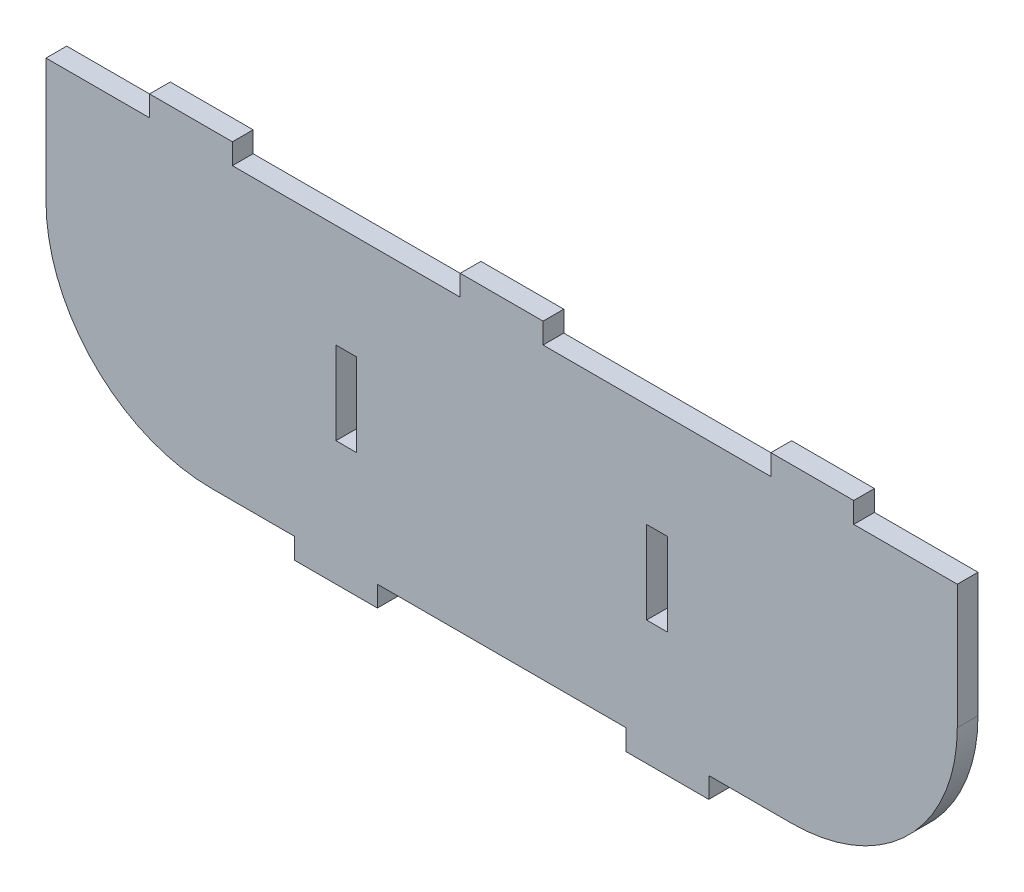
ISO-10303-21;
HEADER;
FILE_DESCRIPTION(('STEP AP214'),'2;1');
FILE_NAME('part.step','',(''),(''),'','','');
FILE_SCHEMA(('AUTOMOTIVE_DESIGN { 1 0 10303 214 1 1 1 1 }'));
ENDSEC;
DATA;
#1=APPLICATION_CONTEXT('core data for automotive mechanical design processes');
#2=APPLICATION_PROTOCOL_DEFINITION('international standard','automotive_design',2000,#1);
#3=PRODUCT_CONTEXT('',#1,'mechanical');
#4=PRODUCT('Part','Part','',(#3));
#5=PRODUCT_RELATED_PRODUCT_CATEGORY('part','',(#4));
#6=PRODUCT_DEFINITION_FORMATION('','',#4);
#7=PRODUCT_DEFINITION_CONTEXT('part definition',#1,'design');
#8=PRODUCT_DEFINITION('design','',#6,#7);
#9=PRODUCT_DEFINITION_SHAPE('','',#8);
#10=(LENGTH_UNIT() NAMED_UNIT(*) SI_UNIT(.MILLI.,.METRE.));
#11=(NAMED_UNIT(*) PLANE_ANGLE_UNIT() SI_UNIT($,.RADIAN.));
#12=(NAMED_UNIT(*) SI_UNIT($,.STERADIAN.) SOLID_ANGLE_UNIT());
#13=UNCERTAINTY_MEASURE_WITH_UNIT(LENGTH_MEASURE(1.E-05),#10,'distance_accuracy_value','');
#14=(GEOMETRIC_REPRESENTATION_CONTEXT(3) GLOBAL_UNCERTAINTY_ASSIGNED_CONTEXT((#13)) GLOBAL_UNIT_ASSIGNED_CONTEXT((#10,
#11,#12)) REPRESENTATION_CONTEXT('',''));
#15=CARTESIAN_POINT('',(0.,0.,0.));
#16=DIRECTION('',(0.,0.,1.));
#17=DIRECTION('',(1.,0.,0.));
#18=AXIS2_PLACEMENT_3D('',#15,#16,#17);
#19=CARTESIAN_POINT('',(-44.45,3.175,1.5875));
#20=DIRECTION('',(0.,0.,-1.));
#21=DIRECTION('',(-1.,0.,0.));
#22=AXIS2_PLACEMENT_3D('',#19,#20,#21);
#23=PLANE('',#22);
#24=DIRECTION('',(0.,1.,0.));
#25=VECTOR('',#24,1.);
#26=CARTESIAN_POINT('',(69.85,3.175,1.5875));
#27=LINE('',#26,#25);
#28=CARTESIAN_POINT('',(69.85,3.17500000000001,1.5875));
#29=VERTEX_POINT('',#28);
#30=CARTESIAN_POINT('',(69.85,22.225,1.5875));
#31=VERTEX_POINT('',#30);
#32=EDGE_CURVE('E443',#29,#31,#27,.T.);
#33=ORIENTED_EDGE('',*,*,#32,.T.);
#34=DIRECTION('',(-1.,0.,0.));
#35=VECTOR('',#34,1.);
#36=CARTESIAN_POINT('',(-69.85,22.225,1.5875));
#37=LINE('',#36,#35);
#38=CARTESIAN_POINT('',(53.975,22.225,1.5875));
#39=VERTEX_POINT('',#38);
#40=EDGE_CURVE('E487',#31,#39,#37,.T.);
#41=ORIENTED_EDGE('',*,*,#40,.T.);
#42=DIRECTION('',(0.,1.,0.));
#43=VECTOR('',#42,1.);
#44=CARTESIAN_POINT('',(53.975,22.225,1.5875));
#45=LINE('',#44,#43);
#46=CARTESIAN_POINT('',(53.975,25.4,1.5875));
#47=VERTEX_POINT('',#46);
#48=EDGE_CURVE('E309',#39,#47,#45,.T.);
#49=ORIENTED_EDGE('',*,*,#48,.T.);
#50=DIRECTION('',(-1.,0.,0.));
#51=VECTOR('',#50,1.);
#52=CARTESIAN_POINT('',(41.275,25.4,1.5875));
#53=LINE('',#52,#51);
#54=CARTESIAN_POINT('',(41.275,25.4,1.5875));
#55=VERTEX_POINT('',#54);
#56=EDGE_CURVE('E305',#47,#55,#53,.T.);
#57=ORIENTED_EDGE('',*,*,#56,.T.);
#58=DIRECTION('',(0.,-1.,0.));
#59=VECTOR('',#58,1.);
#60=CARTESIAN_POINT('',(41.275,22.225,1.5875));
#61=LINE('',#60,#59);
#62=CARTESIAN_POINT('',(41.275,22.225,1.5875));
#63=VERTEX_POINT('',#62);
#64=EDGE_CURVE('E298',#55,#63,#61,.T.);
#65=ORIENTED_EDGE('',*,*,#64,.T.);
#66=CARTESIAN_POINT('',(6.35,22.225,1.5875));
#67=VERTEX_POINT('',#66);
#68=EDGE_CURVE('E499',#63,#67,#37,.T.);
#69=ORIENTED_EDGE('',*,*,#68,.T.);
#70=DIRECTION('',(0.,1.,0.));
#71=VECTOR('',#70,1.);
#72=CARTESIAN_POINT('',(6.35,22.225,1.5875));
#73=LINE('',#72,#71);
#74=CARTESIAN_POINT('',(6.35,25.4,1.5875));
#75=VERTEX_POINT('',#74);
#76=EDGE_CURVE('E336',#67,#75,#73,.T.);
#77=ORIENTED_EDGE('',*,*,#76,.T.);
#78=DIRECTION('',(-1.,0.,0.));
#79=VECTOR('',#78,1.);
#80=CARTESIAN_POINT('',(-6.35,25.4,1.5875));
#81=LINE('',#80,#79);
#82=CARTESIAN_POINT('',(-6.35,25.4,1.5875));
#83=VERTEX_POINT('',#82);
#84=EDGE_CURVE('E332',#75,#83,#81,.T.);
#85=ORIENTED_EDGE('',*,*,#84,.T.);
#86=DIRECTION('',(0.,-1.,0.));
#87=VECTOR('',#86,1.);
#88=CARTESIAN_POINT('',(-6.35,22.225,1.5875));
#89=LINE('',#88,#87);
#90=CARTESIAN_POINT('',(-6.35,22.225,1.5875));
#91=VERTEX_POINT('',#90);
#92=EDGE_CURVE('E331',#83,#91,#89,.T.);
#93=ORIENTED_EDGE('',*,*,#92,.T.);
#94=CARTESIAN_POINT('',(-41.275,22.225,1.5875));
#95=VERTEX_POINT('',#94);
#96=EDGE_CURVE('E403',#91,#95,#37,.T.);
#97=ORIENTED_EDGE('',*,*,#96,.T.);
#98=DIRECTION('',(0.,1.,0.));
#99=VECTOR('',#98,1.);
#100=CARTESIAN_POINT('',(-41.275,22.225,1.5875));
#101=LINE('',#100,#99);
#102=CARTESIAN_POINT('',(-41.275,25.4,1.5875));
#103=VERTEX_POINT('',#102);
#104=EDGE_CURVE('E364',#95,#103,#101,.T.);
#105=ORIENTED_EDGE('',*,*,#104,.T.);
#106=DIRECTION('',(-1.,0.,0.));
#107=VECTOR('',#106,1.);
#108=CARTESIAN_POINT('',(-53.975,25.4,1.5875));
#109=LINE('',#108,#107);
#110=CARTESIAN_POINT('',(-53.975,25.4,1.5875));
#111=VERTEX_POINT('',#110);
#112=EDGE_CURVE('E360',#103,#111,#109,.T.);
#113=ORIENTED_EDGE('',*,*,#112,.T.);
#114=DIRECTION('',(0.,-1.,0.));
#115=VECTOR('',#114,1.);
#116=CARTESIAN_POINT('',(-53.975,22.225,1.5875));
#117=LINE('',#116,#115);
#118=CARTESIAN_POINT('',(-53.975,22.225,1.5875));
#119=VERTEX_POINT('',#118);
#120=EDGE_CURVE('E359',#111,#119,#117,.T.);
#121=ORIENTED_EDGE('',*,*,#120,.T.);
#122=CARTESIAN_POINT('',(-69.85,22.225,1.5875));
#123=VERTEX_POINT('',#122);
#124=EDGE_CURVE('E495',#119,#123,#37,.T.);
#125=ORIENTED_EDGE('',*,*,#124,.T.);
#126=DIRECTION('',(0.,-1.,0.));
#127=VECTOR('',#126,1.);
#128=CARTESIAN_POINT('',(-69.85,3.175,1.5875));
#129=LINE('',#128,#127);
#130=CARTESIAN_POINT('',(-69.85,3.175,1.5875));
#131=VERTEX_POINT('',#130);
#132=EDGE_CURVE('E486',#123,#131,#129,.T.);
#133=ORIENTED_EDGE('',*,*,#132,.T.);
#134=CARTESIAN_POINT('',(-44.45,3.175,1.5875));
#135=DIRECTION('',(0.,0.,1.));
#136=DIRECTION('',(-1.,0.,0.));
#137=AXIS2_PLACEMENT_3D('',#134,#135,#136);
#138=CIRCLE('',#137,25.4);
#139=CARTESIAN_POINT('',(-44.45,-22.225,1.5875));
#140=VERTEX_POINT('',#139);
#141=EDGE_CURVE('E461',#131,#140,#138,.T.);
#142=ORIENTED_EDGE('',*,*,#141,.T.);
#143=DIRECTION('',(1.,0.,0.));
#144=VECTOR('',#143,1.);
#145=CARTESIAN_POINT('',(-44.45,-22.225,1.5875));
#146=LINE('',#145,#144);
#147=CARTESIAN_POINT('',(-31.75,-22.225,1.5875));
#148=VERTEX_POINT('',#147);
#149=EDGE_CURVE('E475',#140,#148,#146,.T.);
#150=ORIENTED_EDGE('',*,*,#149,.T.);
#151=DIRECTION('',(0.,-1.,0.));
#152=VECTOR('',#151,1.);
#153=CARTESIAN_POINT('',(-31.75,-22.225,1.5875));
#154=LINE('',#153,#152);
#155=CARTESIAN_POINT('',(-31.75,-25.4,1.5875));
#156=VERTEX_POINT('',#155);
#157=EDGE_CURVE('E600',#148,#156,#154,.T.);
#158=ORIENTED_EDGE('',*,*,#157,.T.);
#159=DIRECTION('',(1.,0.,0.));
#160=VECTOR('',#159,1.);
#161=CARTESIAN_POINT('',(-31.75,-25.4,1.5875));
#162=LINE('',#161,#160);
#163=CARTESIAN_POINT('',(-19.05,-25.4,1.5875));
#164=VERTEX_POINT('',#163);
#165=EDGE_CURVE('E602',#156,#164,#162,.T.);
#166=ORIENTED_EDGE('',*,*,#165,.T.);
#167=DIRECTION('',(0.,1.,0.));
#168=VECTOR('',#167,1.);
#169=CARTESIAN_POINT('',(-19.05,-22.225,1.5875));
#170=LINE('',#169,#168);
#171=CARTESIAN_POINT('',(-19.05,-22.225,1.5875));
#172=VERTEX_POINT('',#171);
#173=EDGE_CURVE('E599',#164,#172,#170,.T.);
#174=ORIENTED_EDGE('',*,*,#173,.T.);
#175=CARTESIAN_POINT('',(19.05,-22.225,1.5875));
#176=VERTEX_POINT('',#175);
#177=EDGE_CURVE('E479',#172,#176,#146,.T.);
#178=ORIENTED_EDGE('',*,*,#177,.T.);
#179=DIRECTION('',(0.,-1.,0.));
#180=VECTOR('',#179,1.);
#181=CARTESIAN_POINT('',(19.05,-25.4,1.5875));
#182=LINE('',#181,#180);
#183=CARTESIAN_POINT('',(19.05,-25.4,1.5875));
#184=VERTEX_POINT('',#183);
#185=EDGE_CURVE('E393',#176,#184,#182,.T.);
#186=ORIENTED_EDGE('',*,*,#185,.T.);
#187=DIRECTION('',(1.,0.,0.));
#188=VECTOR('',#187,1.);
#189=CARTESIAN_POINT('',(19.05,-25.4,1.5875));
#190=LINE('',#189,#188);
#191=CARTESIAN_POINT('',(31.75,-25.4,1.5875));
#192=VERTEX_POINT('',#191);
#193=EDGE_CURVE('E628',#184,#192,#190,.T.);
#194=ORIENTED_EDGE('',*,*,#193,.T.);
#195=DIRECTION('',(0.,1.,0.));
#196=VECTOR('',#195,1.);
#197=CARTESIAN_POINT('',(31.75,-25.4,1.5875));
#198=LINE('',#197,#196);
#199=CARTESIAN_POINT('',(31.75,-22.225,1.5875));
#200=VERTEX_POINT('',#199);
#201=EDGE_CURVE('E625',#192,#200,#198,.T.);
#202=ORIENTED_EDGE('',*,*,#201,.T.);
#203=CARTESIAN_POINT('',(44.45,-22.225,1.5875));
#204=VERTEX_POINT('',#203);
#205=EDGE_CURVE('E481',#200,#204,#146,.T.);
#206=ORIENTED_EDGE('',*,*,#205,.T.);
#207=CARTESIAN_POINT('',(44.45,3.175,1.5875));
#208=DIRECTION('',(0.,0.,1.));
#209=DIRECTION('',(-1.,0.,0.));
#210=AXIS2_PLACEMENT_3D('',#207,#208,#209);
#211=CIRCLE('',#210,25.4);
#212=EDGE_CURVE('E440',#204,#29,#211,.T.);
#213=ORIENTED_EDGE('',*,*,#212,.T.);
#214=EDGE_LOOP('',(#33,#41,#49,#57,#65,#69,#77,#85,#93,#97,#105,#113,#121,#125,#133,#142,#150,
#158,#166,#174,#178,#186,#194,#202,#206,#213));
#215=FACE_BOUND('',#214,.T.);
#216=DIRECTION('',(-1.,0.,0.));
#217=VECTOR('',#216,1.);
#218=CARTESIAN_POINT('',(-25.4,6.35,1.5875));
#219=LINE('',#218,#217);
#220=CARTESIAN_POINT('',(-22.225,6.35,1.5875));
#221=VERTEX_POINT('',#220);
#222=CARTESIAN_POINT('',(-25.4,6.35,1.5875));
#223=VERTEX_POINT('',#222);
#224=EDGE_CURVE('E286',#221,#223,#219,.T.);
#225=ORIENTED_EDGE('',*,*,#224,.F.);
#226=DIRECTION('',(0.,1.,0.));
#227=VECTOR('',#226,1.);
#228=CARTESIAN_POINT('',(-22.225,6.35,1.5875));
#229=LINE('',#228,#227);
#230=CARTESIAN_POINT('',(-22.225,-6.35,1.5875));
#231=VERTEX_POINT('',#230);
#232=EDGE_CURVE('E282',#231,#221,#229,.T.);
#233=ORIENTED_EDGE('',*,*,#232,.F.);
#234=DIRECTION('',(1.,0.,0.));
#235=VECTOR('',#234,1.);
#236=CARTESIAN_POINT('',(-25.4,-6.35,1.5875));
#237=LINE('',#236,#235);
#238=CARTESIAN_POINT('',(-25.4,-6.35,1.5875));
#239=VERTEX_POINT('',#238);
#240=EDGE_CURVE('E292',#239,#231,#237,.T.);
#241=ORIENTED_EDGE('',*,*,#240,.F.);
#242=DIRECTION('',(0.,-1.,0.));
#243=VECTOR('',#242,1.);
#244=CARTESIAN_POINT('',(-25.4,6.35,1.5875));
#245=LINE('',#244,#243);
#246=EDGE_CURVE('E289',#223,#239,#245,.T.);
#247=ORIENTED_EDGE('',*,*,#246,.F.);
#248=EDGE_LOOP('',(#225,#233,#241,#247));
#249=FACE_BOUND('',#248,.T.);
#250=DIRECTION('',(0.,1.,0.));
#251=VECTOR('',#250,1.);
#252=CARTESIAN_POINT('',(22.225,6.35,1.5875));
#253=LINE('',#252,#251);
#254=CARTESIAN_POINT('',(22.225,-6.35,1.5875));
#255=VERTEX_POINT('',#254);
#256=CARTESIAN_POINT('',(22.225,6.35,1.5875));
#257=VERTEX_POINT('',#256);
#258=EDGE_CURVE('E52',#255,#257,#253,.T.);
#259=ORIENTED_EDGE('',*,*,#258,.T.);
#260=DIRECTION('',(1.,0.,0.));
#261=VECTOR('',#260,1.);
#262=CARTESIAN_POINT('',(25.4,6.35,1.5875));
#263=LINE('',#262,#261);
#264=CARTESIAN_POINT('',(25.4,6.35,1.5875));
#265=VERTEX_POINT('',#264);
#266=EDGE_CURVE('E275',#257,#265,#263,.T.);
#267=ORIENTED_EDGE('',*,*,#266,.T.);
#268=DIRECTION('',(0.,-1.,0.));
#269=VECTOR('',#268,1.);
#270=CARTESIAN_POINT('',(25.4,6.35,1.5875));
#271=LINE('',#270,#269);
#272=CARTESIAN_POINT('',(25.4,-6.35,1.5875));
#273=VERTEX_POINT('',#272);
#274=EDGE_CURVE('E261',#265,#273,#271,.T.);
#275=ORIENTED_EDGE('',*,*,#274,.T.);
#276=DIRECTION('',(-1.,0.,0.));
#277=VECTOR('',#276,1.);
#278=CARTESIAN_POINT('',(25.4,-6.35,1.5875));
#279=LINE('',#278,#277);
#280=EDGE_CURVE('E270',#273,#255,#279,.T.);
#281=ORIENTED_EDGE('',*,*,#280,.T.);
#282=EDGE_LOOP('',(#259,#267,#275,#281));
#283=FACE_BOUND('',#282,.T.);
#284=ADVANCED_FACE('F37',(#215,#249,#283),#23,.F.);
#285=CARTESIAN_POINT('',(-44.45,3.175,-1.5875));
#286=DIRECTION('',(0.,0.,-1.));
#287=DIRECTION('',(-1.,0.,0.));
#288=AXIS2_PLACEMENT_3D('',#285,#286,#287);
#289=PLANE('',#288);
#290=DIRECTION('',(0.,-1.,0.));
#291=VECTOR('',#290,1.);
#292=CARTESIAN_POINT('',(-22.225,3.17500000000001,-1.5875));
#293=LINE('',#292,#291);
#294=CARTESIAN_POINT('',(-22.225,6.35,-1.5875));
#295=VERTEX_POINT('',#294);
#296=CARTESIAN_POINT('',(-22.225,-6.35,-1.5875));
#297=VERTEX_POINT('',#296);
#298=EDGE_CURVE('E509',#295,#297,#293,.T.);
#299=ORIENTED_EDGE('',*,*,#298,.F.);
#300=DIRECTION('',(1.,0.,0.));
#301=VECTOR('',#300,1.);
#302=CARTESIAN_POINT('',(-44.45,6.35,-1.5875));
#303=LINE('',#302,#301);
#304=CARTESIAN_POINT('',(-25.4,6.35,-1.5875));
#305=VERTEX_POINT('',#304);
#306=EDGE_CURVE('E424',#305,#295,#303,.T.);
#307=ORIENTED_EDGE('',*,*,#306,.F.);
#308=DIRECTION('',(0.,1.,0.));
#309=VECTOR('',#308,1.);
#310=CARTESIAN_POINT('',(-25.4,3.175,-1.5875));
#311=LINE('',#310,#309);
#312=CARTESIAN_POINT('',(-25.4,-6.35,-1.5875));
#313=VERTEX_POINT('',#312);
#314=EDGE_CURVE('E504',#313,#305,#311,.T.);
#315=ORIENTED_EDGE('',*,*,#314,.F.);
#316=DIRECTION('',(-1.,0.,0.));
#317=VECTOR('',#316,1.);
#318=CARTESIAN_POINT('',(-44.45,-6.35,-1.5875));
#319=LINE('',#318,#317);
#320=EDGE_CURVE('E507',#297,#313,#319,.T.);
#321=ORIENTED_EDGE('',*,*,#320,.F.);
#322=EDGE_LOOP('',(#299,#307,#315,#321));
#323=FACE_BOUND('',#322,.T.);
#324=DIRECTION('',(0.,1.,0.));
#325=VECTOR('',#324,1.);
#326=CARTESIAN_POINT('',(69.85,3.175,-1.5875));
#327=LINE('',#326,#325);
#328=CARTESIAN_POINT('',(69.85,3.17500000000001,-1.5875));
#329=VERTEX_POINT('',#328);
#330=CARTESIAN_POINT('',(69.85,22.225,-1.5875));
#331=VERTEX_POINT('',#330);
#332=EDGE_CURVE('E409',#329,#331,#327,.T.);
#333=ORIENTED_EDGE('',*,*,#332,.F.);
#334=CARTESIAN_POINT('',(44.45,3.175,-1.5875));
#335=DIRECTION('',(0.,0.,1.));
#336=DIRECTION('',(-1.,0.,0.));
#337=AXIS2_PLACEMENT_3D('',#334,#335,#336);
#338=CIRCLE('',#337,25.4);
#339=CARTESIAN_POINT('',(44.45,-22.225,-1.5875));
#340=VERTEX_POINT('',#339);
#341=EDGE_CURVE('E441',#340,#329,#338,.T.);
#342=ORIENTED_EDGE('',*,*,#341,.F.);
#343=DIRECTION('',(1.,0.,0.));
#344=VECTOR('',#343,1.);
#345=CARTESIAN_POINT('',(-44.45,-22.225,-1.5875));
#346=LINE('',#345,#344);
#347=CARTESIAN_POINT('',(31.75,-22.225,-1.5875));
#348=VERTEX_POINT('',#347);
#349=EDGE_CURVE('E446',#348,#340,#346,.T.);
#350=ORIENTED_EDGE('',*,*,#349,.F.);
#351=DIRECTION('',(0.,1.,0.));
#352=VECTOR('',#351,1.);
#353=CARTESIAN_POINT('',(31.75,-25.4,-1.5875));
#354=LINE('',#353,#352);
#355=CARTESIAN_POINT('',(31.75,-25.4,-1.5875));
#356=VERTEX_POINT('',#355);
#357=EDGE_CURVE('E612',#356,#348,#354,.T.);
#358=ORIENTED_EDGE('',*,*,#357,.F.);
#359=DIRECTION('',(1.,0.,0.));
#360=VECTOR('',#359,1.);
#361=CARTESIAN_POINT('',(19.05,-25.4,-1.5875));
#362=LINE('',#361,#360);
#363=CARTESIAN_POINT('',(19.05,-25.4,-1.5875));
#364=VERTEX_POINT('',#363);
#365=EDGE_CURVE('E613',#364,#356,#362,.T.);
#366=ORIENTED_EDGE('',*,*,#365,.F.);
#367=DIRECTION('',(0.,-1.,0.));
#368=VECTOR('',#367,1.);
#369=CARTESIAN_POINT('',(19.05,-25.4,-1.5875));
#370=LINE('',#369,#368);
#371=CARTESIAN_POINT('',(19.05,-22.225,-1.5875));
#372=VERTEX_POINT('',#371);
#373=EDGE_CURVE('E609',#372,#364,#370,.T.);
#374=ORIENTED_EDGE('',*,*,#373,.F.);
#375=CARTESIAN_POINT('',(-19.05,-22.225,-1.5875));
#376=VERTEX_POINT('',#375);
#377=EDGE_CURVE('E445',#376,#372,#346,.T.);
#378=ORIENTED_EDGE('',*,*,#377,.F.);
#379=DIRECTION('',(0.,1.,0.));
#380=VECTOR('',#379,1.);
#381=CARTESIAN_POINT('',(-19.05,-22.225,-1.5875));
#382=LINE('',#381,#380);
#383=CARTESIAN_POINT('',(-19.05,-25.4,-1.5875));
#384=VERTEX_POINT('',#383);
#385=EDGE_CURVE('E589',#384,#376,#382,.T.);
#386=ORIENTED_EDGE('',*,*,#385,.F.);
#387=DIRECTION('',(1.,0.,0.));
#388=VECTOR('',#387,1.);
#389=CARTESIAN_POINT('',(-31.75,-25.4,-1.5875));
#390=LINE('',#389,#388);
#391=CARTESIAN_POINT('',(-31.75,-25.4,-1.5875));
#392=VERTEX_POINT('',#391);
#393=EDGE_CURVE('E590',#392,#384,#390,.T.);
#394=ORIENTED_EDGE('',*,*,#393,.F.);
#395=DIRECTION('',(0.,-1.,0.));
#396=VECTOR('',#395,1.);
#397=CARTESIAN_POINT('',(-31.75,-22.225,-1.5875));
#398=LINE('',#397,#396);
#399=CARTESIAN_POINT('',(-31.75,-22.225,-1.5875));
#400=VERTEX_POINT('',#399);
#401=EDGE_CURVE('E468',#400,#392,#398,.T.);
#402=ORIENTED_EDGE('',*,*,#401,.F.);
#403=CARTESIAN_POINT('',(-44.45,-22.225,-1.5875));
#404=VERTEX_POINT('',#403);
#405=EDGE_CURVE('E444',#404,#400,#346,.T.);
#406=ORIENTED_EDGE('',*,*,#405,.F.);
#407=CARTESIAN_POINT('',(-44.45,3.175,-1.5875));
#408=DIRECTION('',(0.,0.,1.));
#409=DIRECTION('',(-1.,0.,0.));
#410=AXIS2_PLACEMENT_3D('',#407,#408,#409);
#411=CIRCLE('',#410,25.4);
#412=CARTESIAN_POINT('',(-69.85,3.175,-1.5875));
#413=VERTEX_POINT('',#412);
#414=EDGE_CURVE('E447',#413,#404,#411,.T.);
#415=ORIENTED_EDGE('',*,*,#414,.F.);
#416=DIRECTION('',(0.,-1.,0.));
#417=VECTOR('',#416,1.);
#418=CARTESIAN_POINT('',(-69.85,3.175,-1.5875));
#419=LINE('',#418,#417);
#420=CARTESIAN_POINT('',(-69.85,22.225,-1.5875));
#421=VERTEX_POINT('',#420);
#422=EDGE_CURVE('E411',#421,#413,#419,.T.);
#423=ORIENTED_EDGE('',*,*,#422,.F.);
#424=DIRECTION('',(-1.,0.,0.));
#425=VECTOR('',#424,1.);
#426=CARTESIAN_POINT('',(-69.85,22.225,-1.5875));
#427=LINE('',#426,#425);
#428=CARTESIAN_POINT('',(-53.975,22.225,-1.5875));
#429=VERTEX_POINT('',#428);
#430=EDGE_CURVE('E402',#429,#421,#427,.T.);
#431=ORIENTED_EDGE('',*,*,#430,.F.);
#432=DIRECTION('',(0.,-1.,0.));
#433=VECTOR('',#432,1.);
#434=CARTESIAN_POINT('',(-53.975,22.225,-1.5875));
#435=LINE('',#434,#433);
#436=CARTESIAN_POINT('',(-53.975,25.4,-1.5875));
#437=VERTEX_POINT('',#436);
#438=EDGE_CURVE('E371',#437,#429,#435,.T.);
#439=ORIENTED_EDGE('',*,*,#438,.F.);
#440=DIRECTION('',(-1.,0.,0.));
#441=VECTOR('',#440,1.);
#442=CARTESIAN_POINT('',(-53.975,25.4,-1.5875));
#443=LINE('',#442,#441);
#444=CARTESIAN_POINT('',(-41.275,25.4,-1.5875));
#445=VERTEX_POINT('',#444);
#446=EDGE_CURVE('E365',#445,#437,#443,.T.);
#447=ORIENTED_EDGE('',*,*,#446,.F.);
#448=DIRECTION('',(0.,1.,0.));
#449=VECTOR('',#448,1.);
#450=CARTESIAN_POINT('',(-41.275,22.225,-1.5875));
#451=LINE('',#450,#449);
#452=CARTESIAN_POINT('',(-41.275,22.225,-1.5875));
#453=VERTEX_POINT('',#452);
#454=EDGE_CURVE('E373',#453,#445,#451,.T.);
#455=ORIENTED_EDGE('',*,*,#454,.F.);
#456=CARTESIAN_POINT('',(-6.35,22.225,-1.5875));
#457=VERTEX_POINT('',#456);
#458=EDGE_CURVE('E398',#457,#453,#427,.T.);
#459=ORIENTED_EDGE('',*,*,#458,.F.);
#460=DIRECTION('',(0.,-1.,0.));
#461=VECTOR('',#460,1.);
#462=CARTESIAN_POINT('',(-6.35,22.225,-1.5875));
#463=LINE('',#462,#461);
#464=CARTESIAN_POINT('',(-6.35,25.4,-1.5875));
#465=VERTEX_POINT('',#464);
#466=EDGE_CURVE('E341',#465,#457,#463,.T.);
#467=ORIENTED_EDGE('',*,*,#466,.F.);
#468=DIRECTION('',(-1.,0.,0.));
#469=VECTOR('',#468,1.);
#470=CARTESIAN_POINT('',(-6.35,25.4,-1.5875));
#471=LINE('',#470,#469);
#472=CARTESIAN_POINT('',(6.35,25.4,-1.5875));
#473=VERTEX_POINT('',#472);
#474=EDGE_CURVE('E346',#473,#465,#471,.T.);
#475=ORIENTED_EDGE('',*,*,#474,.F.);
#476=DIRECTION('',(0.,1.,0.));
#477=VECTOR('',#476,1.);
#478=CARTESIAN_POINT('',(6.35,22.225,-1.5875));
#479=LINE('',#478,#477);
#480=CARTESIAN_POINT('',(6.35,22.225,-1.5875));
#481=VERTEX_POINT('',#480);
#482=EDGE_CURVE('E350',#481,#473,#479,.T.);
#483=ORIENTED_EDGE('',*,*,#482,.F.);
#484=CARTESIAN_POINT('',(41.275,22.225,-1.5875));
#485=VERTEX_POINT('',#484);
#486=EDGE_CURVE('E401',#485,#481,#427,.T.);
#487=ORIENTED_EDGE('',*,*,#486,.F.);
#488=DIRECTION('',(0.,-1.,0.));
#489=VECTOR('',#488,1.);
#490=CARTESIAN_POINT('',(41.275,22.225,-1.5875));
#491=LINE('',#490,#489);
#492=CARTESIAN_POINT('',(41.275,25.4,-1.5875));
#493=VERTEX_POINT('',#492);
#494=EDGE_CURVE('E314',#493,#485,#491,.T.);
#495=ORIENTED_EDGE('',*,*,#494,.F.);
#496=DIRECTION('',(-1.,0.,0.));
#497=VECTOR('',#496,1.);
#498=CARTESIAN_POINT('',(41.275,25.4,-1.5875));
#499=LINE('',#498,#497);
#500=CARTESIAN_POINT('',(53.975,25.4,-1.5875));
#501=VERTEX_POINT('',#500);
#502=EDGE_CURVE('E319',#501,#493,#499,.T.);
#503=ORIENTED_EDGE('',*,*,#502,.F.);
#504=DIRECTION('',(0.,1.,0.));
#505=VECTOR('',#504,1.);
#506=CARTESIAN_POINT('',(53.975,22.225,-1.5875));
#507=LINE('',#506,#505);
#508=CARTESIAN_POINT('',(53.975,22.225,-1.5875));
#509=VERTEX_POINT('',#508);
#510=EDGE_CURVE('E323',#509,#501,#507,.T.);
#511=ORIENTED_EDGE('',*,*,#510,.F.);
#512=EDGE_CURVE('E419',#331,#509,#427,.T.);
#513=ORIENTED_EDGE('',*,*,#512,.F.);
#514=EDGE_LOOP('',(#333,#342,#350,#358,#366,#374,#378,#386,#394,#402,#406,#415,#423,#431,#439,
#447,#455,#459,#467,#475,#483,#487,#495,#503,#511,#513));
#515=FACE_BOUND('',#514,.T.);
#516=DIRECTION('',(-1.,0.,0.));
#517=VECTOR('',#516,1.);
#518=CARTESIAN_POINT('',(-44.45,6.35,-1.5875));
#519=LINE('',#518,#517);
#520=CARTESIAN_POINT('',(25.4,6.35,-1.5875));
#521=VERTEX_POINT('',#520);
#522=CARTESIAN_POINT('',(22.225,6.35,-1.5875));
#523=VERTEX_POINT('',#522);
#524=EDGE_CURVE('E45',#521,#523,#519,.T.);
#525=ORIENTED_EDGE('',*,*,#524,.T.);
#526=DIRECTION('',(0.,-1.,0.));
#527=VECTOR('',#526,1.);
#528=CARTESIAN_POINT('',(22.225,3.17499999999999,-1.5875));
#529=LINE('',#528,#527);
#530=CARTESIAN_POINT('',(22.225,-6.35,-1.5875));
#531=VERTEX_POINT('',#530);
#532=EDGE_CURVE('E11',#523,#531,#529,.T.);
#533=ORIENTED_EDGE('',*,*,#532,.T.);
#534=DIRECTION('',(1.,0.,0.));
#535=VECTOR('',#534,1.);
#536=CARTESIAN_POINT('',(-44.45,-6.35,-1.5875));
#537=LINE('',#536,#535);
#538=CARTESIAN_POINT('',(25.4,-6.35,-1.5875));
#539=VERTEX_POINT('',#538);
#540=EDGE_CURVE('E511',#531,#539,#537,.T.);
#541=ORIENTED_EDGE('',*,*,#540,.T.);
#542=DIRECTION('',(0.,1.,0.));
#543=VECTOR('',#542,1.);
#544=CARTESIAN_POINT('',(25.4,3.175,-1.5875));
#545=LINE('',#544,#543);
#546=EDGE_CURVE('E264',#539,#521,#545,.T.);
#547=ORIENTED_EDGE('',*,*,#546,.T.);
#548=EDGE_LOOP('',(#525,#533,#541,#547));
#549=FACE_BOUND('',#548,.T.);
#550=ADVANCED_FACE('F464',(#323,#515,#549),#289,.T.);
#551=CARTESIAN_POINT('',(-69.85,22.225,1.5875));
#552=DIRECTION('',(0.,-1.,0.));
#553=DIRECTION('',(0.,0.,-1.));
#554=AXIS2_PLACEMENT_3D('',#551,#552,#553);
#555=PLANE('',#554);
#556=ORIENTED_EDGE('',*,*,#512,.T.);
#557=DIRECTION('',(0.,0.,1.));
#558=VECTOR('',#557,1.);
#559=CARTESIAN_POINT('',(53.975,22.225,-14.6783603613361));
#560=LINE('',#559,#558);
#561=EDGE_CURVE('E308',#509,#39,#560,.T.);
#562=ORIENTED_EDGE('',*,*,#561,.T.);
#563=ORIENTED_EDGE('',*,*,#40,.F.);
#564=DIRECTION('',(0.,0.,-1.));
#565=VECTOR('',#564,1.);
#566=CARTESIAN_POINT('',(69.85,22.225,1.5875));
#567=LINE('',#566,#565);
#568=EDGE_CURVE('E421',#31,#331,#567,.T.);
#569=ORIENTED_EDGE('',*,*,#568,.T.);
#570=EDGE_LOOP('',(#556,#562,#563,#569));
#571=FACE_BOUND('',#570,.T.);
#572=ADVANCED_FACE('F536',(#571),#555,.F.);
#573=ORIENTED_EDGE('',*,*,#68,.F.);
#574=DIRECTION('',(0.,0.,1.));
#575=VECTOR('',#574,1.);
#576=CARTESIAN_POINT('',(41.275,22.225,-14.6783603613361));
#577=LINE('',#576,#575);
#578=EDGE_CURVE('E317',#485,#63,#577,.T.);
#579=ORIENTED_EDGE('',*,*,#578,.F.);
#580=ORIENTED_EDGE('',*,*,#486,.T.);
#581=DIRECTION('',(0.,0.,1.));
#582=VECTOR('',#581,1.);
#583=CARTESIAN_POINT('',(6.35,22.225,-14.6783603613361));
#584=LINE('',#583,#582);
#585=EDGE_CURVE('E335',#481,#67,#584,.T.);
#586=ORIENTED_EDGE('',*,*,#585,.T.);
#587=EDGE_LOOP('',(#573,#579,#580,#586));
#588=FACE_BOUND('',#587,.T.);
#589=ADVANCED_FACE('F564',(#588),#555,.F.);
#590=DIRECTION('',(0.,0.,1.));
#591=VECTOR('',#590,1.);
#592=CARTESIAN_POINT('',(-53.975,22.225,-14.6783603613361));
#593=LINE('',#592,#591);
#594=EDGE_CURVE('E389',#429,#119,#593,.T.);
#595=ORIENTED_EDGE('',*,*,#594,.F.);
#596=ORIENTED_EDGE('',*,*,#430,.T.);
#597=DIRECTION('',(0.,0.,-1.));
#598=VECTOR('',#597,1.);
#599=CARTESIAN_POINT('',(-69.85,22.225,1.5875));
#600=LINE('',#599,#598);
#601=EDGE_CURVE('E425',#123,#421,#600,.T.);
#602=ORIENTED_EDGE('',*,*,#601,.F.);
#603=ORIENTED_EDGE('',*,*,#124,.F.);
#604=EDGE_LOOP('',(#595,#596,#602,#603));
#605=FACE_BOUND('',#604,.T.);
#606=ADVANCED_FACE('F558',(#605),#555,.F.);
#607=CARTESIAN_POINT('',(-44.45,-22.225,1.5875));
#608=DIRECTION('',(0.,1.,0.));
#609=DIRECTION('',(0.,0.,1.));
#610=AXIS2_PLACEMENT_3D('',#607,#608,#609);
#611=PLANE('',#610);
#612=ORIENTED_EDGE('',*,*,#205,.F.);
#613=DIRECTION('',(0.,0.,1.));
#614=VECTOR('',#613,1.);
#615=CARTESIAN_POINT('',(31.75,-22.225,-14.6783603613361));
#616=LINE('',#615,#614);
#617=EDGE_CURVE('E614',#348,#200,#616,.T.);
#618=ORIENTED_EDGE('',*,*,#617,.F.);
#619=ORIENTED_EDGE('',*,*,#349,.T.);
#620=DIRECTION('',(0.,0.,-1.));
#621=VECTOR('',#620,1.);
#622=CARTESIAN_POINT('',(44.45,-22.225,1.5875));
#623=LINE('',#622,#621);
#624=EDGE_CURVE('E434',#204,#340,#623,.T.);
#625=ORIENTED_EDGE('',*,*,#624,.F.);
#626=EDGE_LOOP('',(#612,#618,#619,#625));
#627=FACE_BOUND('',#626,.T.);
#628=ADVANCED_FACE('F550',(#627),#611,.F.);
#629=ORIENTED_EDGE('',*,*,#377,.T.);
#630=DIRECTION('',(0.,0.,1.));
#631=VECTOR('',#630,1.);
#632=CARTESIAN_POINT('',(19.05,-22.225,-14.6783603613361));
#633=LINE('',#632,#631);
#634=EDGE_CURVE('E617',#372,#176,#633,.T.);
#635=ORIENTED_EDGE('',*,*,#634,.T.);
#636=ORIENTED_EDGE('',*,*,#177,.F.);
#637=DIRECTION('',(0.,0.,1.));
#638=VECTOR('',#637,1.);
#639=CARTESIAN_POINT('',(-19.05,-22.225,-14.6783603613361));
#640=LINE('',#639,#638);
#641=EDGE_CURVE('E591',#376,#172,#640,.T.);
#642=ORIENTED_EDGE('',*,*,#641,.F.);
#643=EDGE_LOOP('',(#629,#635,#636,#642));
#644=FACE_BOUND('',#643,.T.);
#645=ADVANCED_FACE('F551',(#644),#611,.F.);
#646=CARTESIAN_POINT('',(69.85,3.175,1.5875));
#647=DIRECTION('',(-1.,0.,0.));
#648=DIRECTION('',(0.,0.,1.));
#649=AXIS2_PLACEMENT_3D('',#646,#647,#648);
#650=PLANE('',#649);
#651=ORIENTED_EDGE('',*,*,#332,.T.);
#652=ORIENTED_EDGE('',*,*,#568,.F.);
#653=ORIENTED_EDGE('',*,*,#32,.F.);
#654=DIRECTION('',(0.,0.,-1.));
#655=VECTOR('',#654,1.);
#656=CARTESIAN_POINT('',(69.85,3.17500000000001,1.5875));
#657=LINE('',#656,#655);
#658=EDGE_CURVE('E437',#29,#329,#657,.T.);
#659=ORIENTED_EDGE('',*,*,#658,.T.);
#660=EDGE_LOOP('',(#651,#652,#653,#659));
#661=FACE_BOUND('',#660,.T.);
#662=ADVANCED_FACE('F39',(#661),#650,.F.);
#663=ORIENTED_EDGE('',*,*,#96,.F.);
#664=DIRECTION('',(0.,0.,1.));
#665=VECTOR('',#664,1.);
#666=CARTESIAN_POINT('',(-6.35,22.225,-14.6783603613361));
#667=LINE('',#666,#665);
#668=EDGE_CURVE('E344',#457,#91,#667,.T.);
#669=ORIENTED_EDGE('',*,*,#668,.F.);
#670=ORIENTED_EDGE('',*,*,#458,.T.);
#671=DIRECTION('',(0.,0.,1.));
#672=VECTOR('',#671,1.);
#673=CARTESIAN_POINT('',(-41.275,22.225,-14.6783603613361));
#674=LINE('',#673,#672);
#675=EDGE_CURVE('E363',#453,#95,#674,.T.);
#676=ORIENTED_EDGE('',*,*,#675,.T.);
#677=EDGE_LOOP('',(#663,#669,#670,#676));
#678=FACE_BOUND('',#677,.T.);
#679=ADVANCED_FACE('F555',(#678),#555,.F.);
#680=CARTESIAN_POINT('',(-69.85,3.175,1.5875));
#681=DIRECTION('',(1.,0.,0.));
#682=DIRECTION('',(0.,0.,-1.));
#683=AXIS2_PLACEMENT_3D('',#680,#681,#682);
#684=PLANE('',#683);
#685=ORIENTED_EDGE('',*,*,#422,.T.);
#686=DIRECTION('',(0.,0.,-1.));
#687=VECTOR('',#686,1.);
#688=CARTESIAN_POINT('',(-69.85,3.175,1.5875));
#689=LINE('',#688,#687);
#690=EDGE_CURVE('E428',#131,#413,#689,.T.);
#691=ORIENTED_EDGE('',*,*,#690,.F.);
#692=ORIENTED_EDGE('',*,*,#132,.F.);
#693=ORIENTED_EDGE('',*,*,#601,.T.);
#694=EDGE_LOOP('',(#685,#691,#692,#693));
#695=FACE_BOUND('',#694,.T.);
#696=ADVANCED_FACE('F454',(#695),#684,.F.);
#697=CARTESIAN_POINT('',(-44.45,3.175,1.5875));
#698=DIRECTION('',(0.,0.,-1.));
#699=DIRECTION('',(-1.,0.,0.));
#700=AXIS2_PLACEMENT_3D('',#697,#698,#699);
#701=CYLINDRICAL_SURFACE('',#700,25.4);
#702=ORIENTED_EDGE('',*,*,#414,.T.);
#703=DIRECTION('',(0.,0.,-1.));
#704=VECTOR('',#703,1.);
#705=CARTESIAN_POINT('',(-44.45,-22.225,1.5875));
#706=LINE('',#705,#704);
#707=EDGE_CURVE('E431',#140,#404,#706,.T.);
#708=ORIENTED_EDGE('',*,*,#707,.F.);
#709=ORIENTED_EDGE('',*,*,#141,.F.);
#710=ORIENTED_EDGE('',*,*,#690,.T.);
#711=EDGE_LOOP('',(#702,#708,#709,#710));
#712=FACE_BOUND('',#711,.T.);
#713=ADVANCED_FACE('F460',(#712),#701,.T.);
#714=ORIENTED_EDGE('',*,*,#405,.T.);
#715=DIRECTION('',(0.,0.,1.));
#716=VECTOR('',#715,1.);
#717=CARTESIAN_POINT('',(-31.75,-22.225,-14.6783603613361));
#718=LINE('',#717,#716);
#719=EDGE_CURVE('E473',#400,#148,#718,.T.);
#720=ORIENTED_EDGE('',*,*,#719,.T.);
#721=ORIENTED_EDGE('',*,*,#149,.F.);
#722=ORIENTED_EDGE('',*,*,#707,.T.);
#723=EDGE_LOOP('',(#714,#720,#721,#722));
#724=FACE_BOUND('',#723,.T.);
#725=ADVANCED_FACE('F471',(#724),#611,.F.);
#726=CARTESIAN_POINT('',(44.45,3.175,1.5875));
#727=DIRECTION('',(0.,0.,-1.));
#728=DIRECTION('',(-1.,0.,0.));
#729=AXIS2_PLACEMENT_3D('',#726,#727,#728);
#730=CYLINDRICAL_SURFACE('',#729,25.4);
#731=ORIENTED_EDGE('',*,*,#341,.T.);
#732=ORIENTED_EDGE('',*,*,#658,.F.);
#733=ORIENTED_EDGE('',*,*,#212,.F.);
#734=ORIENTED_EDGE('',*,*,#624,.T.);
#735=EDGE_LOOP('',(#731,#732,#733,#734));
#736=FACE_BOUND('',#735,.T.);
#737=ADVANCED_FACE('F544',(#736),#730,.T.);
#738=CARTESIAN_POINT('',(-31.75,-25.4,-14.6783603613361));
#739=DIRECTION('',(0.,-1.,0.));
#740=DIRECTION('',(0.,0.,-1.));
#741=AXIS2_PLACEMENT_3D('',#738,#739,#740);
#742=PLANE('',#741);
#743=DIRECTION('',(0.,0.,1.));
#744=VECTOR('',#743,1.);
#745=CARTESIAN_POINT('',(-31.75,-25.4,-14.6783603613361));
#746=LINE('',#745,#744);
#747=EDGE_CURVE('E580',#392,#156,#746,.T.);
#748=ORIENTED_EDGE('',*,*,#747,.F.);
#749=ORIENTED_EDGE('',*,*,#393,.T.);
#750=DIRECTION('',(0.,0.,1.));
#751=VECTOR('',#750,1.);
#752=CARTESIAN_POINT('',(-19.05,-25.4,-14.6783603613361));
#753=LINE('',#752,#751);
#754=EDGE_CURVE('E587',#384,#164,#753,.T.);
#755=ORIENTED_EDGE('',*,*,#754,.T.);
#756=ORIENTED_EDGE('',*,*,#165,.F.);
#757=EDGE_LOOP('',(#748,#749,#755,#756));
#758=FACE_BOUND('',#757,.T.);
#759=ADVANCED_FACE('F541',(#758),#742,.T.);
#760=CARTESIAN_POINT('',(-19.05,-22.225,-14.6783603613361));
#761=DIRECTION('',(1.,0.,0.));
#762=DIRECTION('',(0.,1.,0.));
#763=AXIS2_PLACEMENT_3D('',#760,#761,#762);
#764=PLANE('',#763);
#765=ORIENTED_EDGE('',*,*,#754,.F.);
#766=ORIENTED_EDGE('',*,*,#385,.T.);
#767=ORIENTED_EDGE('',*,*,#641,.T.);
#768=ORIENTED_EDGE('',*,*,#173,.F.);
#769=EDGE_LOOP('',(#765,#766,#767,#768));
#770=FACE_BOUND('',#769,.T.);
#771=ADVANCED_FACE('F702',(#770),#764,.T.);
#772=CARTESIAN_POINT('',(-31.75,-22.225,-14.6783603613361));
#773=DIRECTION('',(-1.,0.,0.));
#774=DIRECTION('',(0.,-1.,0.));
#775=AXIS2_PLACEMENT_3D('',#772,#773,#774);
#776=PLANE('',#775);
#777=ORIENTED_EDGE('',*,*,#719,.F.);
#778=ORIENTED_EDGE('',*,*,#401,.T.);
#779=ORIENTED_EDGE('',*,*,#747,.T.);
#780=ORIENTED_EDGE('',*,*,#157,.F.);
#781=EDGE_LOOP('',(#777,#778,#779,#780));
#782=FACE_BOUND('',#781,.T.);
#783=ADVANCED_FACE('F699',(#782),#776,.T.);
#784=CARTESIAN_POINT('',(19.05,-25.4,-14.6783603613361));
#785=DIRECTION('',(0.,-1.,0.));
#786=DIRECTION('',(0.,0.,-1.));
#787=AXIS2_PLACEMENT_3D('',#784,#785,#786);
#788=PLANE('',#787);
#789=DIRECTION('',(0.,0.,1.));
#790=VECTOR('',#789,1.);
#791=CARTESIAN_POINT('',(19.05,-25.4,-14.6783603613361));
#792=LINE('',#791,#790);
#793=EDGE_CURVE('E603',#364,#184,#792,.T.);
#794=ORIENTED_EDGE('',*,*,#793,.F.);
#795=ORIENTED_EDGE('',*,*,#365,.T.);
#796=DIRECTION('',(0.,0.,1.));
#797=VECTOR('',#796,1.);
#798=CARTESIAN_POINT('',(31.75,-25.4,-14.6783603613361));
#799=LINE('',#798,#797);
#800=EDGE_CURVE('E610',#356,#192,#799,.T.);
#801=ORIENTED_EDGE('',*,*,#800,.T.);
#802=ORIENTED_EDGE('',*,*,#193,.F.);
#803=EDGE_LOOP('',(#794,#795,#801,#802));
#804=FACE_BOUND('',#803,.T.);
#805=ADVANCED_FACE('F696',(#804),#788,.T.);
#806=CARTESIAN_POINT('',(31.75,-25.4,-14.6783603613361));
#807=DIRECTION('',(1.,0.,0.));
#808=DIRECTION('',(0.,0.,-1.));
#809=AXIS2_PLACEMENT_3D('',#806,#807,#808);
#810=PLANE('',#809);
#811=ORIENTED_EDGE('',*,*,#800,.F.);
#812=ORIENTED_EDGE('',*,*,#357,.T.);
#813=ORIENTED_EDGE('',*,*,#617,.T.);
#814=ORIENTED_EDGE('',*,*,#201,.F.);
#815=EDGE_LOOP('',(#811,#812,#813,#814));
#816=FACE_BOUND('',#815,.T.);
#817=ADVANCED_FACE('F634',(#816),#810,.T.);
#818=CARTESIAN_POINT('',(19.05,-25.4,-14.6783603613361));
#819=DIRECTION('',(-1.,0.,0.));
#820=DIRECTION('',(0.,0.,1.));
#821=AXIS2_PLACEMENT_3D('',#818,#819,#820);
#822=PLANE('',#821);
#823=ORIENTED_EDGE('',*,*,#634,.F.);
#824=ORIENTED_EDGE('',*,*,#373,.T.);
#825=ORIENTED_EDGE('',*,*,#793,.T.);
#826=ORIENTED_EDGE('',*,*,#185,.F.);
#827=EDGE_LOOP('',(#823,#824,#825,#826));
#828=FACE_BOUND('',#827,.T.);
#829=ADVANCED_FACE('F690',(#828),#822,.T.);
#830=CARTESIAN_POINT('',(-41.275,22.225,-14.6783603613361));
#831=DIRECTION('',(1.,0.,0.));
#832=DIRECTION('',(0.,0.,-1.));
#833=AXIS2_PLACEMENT_3D('',#830,#831,#832);
#834=PLANE('',#833);
#835=ORIENTED_EDGE('',*,*,#675,.F.);
#836=ORIENTED_EDGE('',*,*,#454,.T.);
#837=DIRECTION('',(0.,0.,1.));
#838=VECTOR('',#837,1.);
#839=CARTESIAN_POINT('',(-41.275,25.4,-14.6783603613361));
#840=LINE('',#839,#838);
#841=EDGE_CURVE('E369',#445,#103,#840,.T.);
#842=ORIENTED_EDGE('',*,*,#841,.T.);
#843=ORIENTED_EDGE('',*,*,#104,.F.);
#844=EDGE_LOOP('',(#835,#836,#842,#843));
#845=FACE_BOUND('',#844,.T.);
#846=ADVANCED_FACE('F672',(#845),#834,.T.);
#847=CARTESIAN_POINT('',(-53.975,25.4,-14.6783603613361));
#848=DIRECTION('',(0.,1.,0.));
#849=DIRECTION('',(0.,0.,1.));
#850=AXIS2_PLACEMENT_3D('',#847,#848,#849);
#851=PLANE('',#850);
#852=ORIENTED_EDGE('',*,*,#841,.F.);
#853=ORIENTED_EDGE('',*,*,#446,.T.);
#854=DIRECTION('',(0.,0.,1.));
#855=VECTOR('',#854,1.);
#856=CARTESIAN_POINT('',(-53.975,25.4,-14.6783603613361));
#857=LINE('',#856,#855);
#858=EDGE_CURVE('E368',#437,#111,#857,.T.);
#859=ORIENTED_EDGE('',*,*,#858,.T.);
#860=ORIENTED_EDGE('',*,*,#112,.F.);
#861=EDGE_LOOP('',(#852,#853,#859,#860));
#862=FACE_BOUND('',#861,.T.);
#863=ADVANCED_FACE('F676',(#862),#851,.T.);
#864=CARTESIAN_POINT('',(-53.975,22.225,-14.6783603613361));
#865=DIRECTION('',(-1.,0.,0.));
#866=DIRECTION('',(0.,0.,1.));
#867=AXIS2_PLACEMENT_3D('',#864,#865,#866);
#868=PLANE('',#867);
#869=ORIENTED_EDGE('',*,*,#858,.F.);
#870=ORIENTED_EDGE('',*,*,#438,.T.);
#871=ORIENTED_EDGE('',*,*,#594,.T.);
#872=ORIENTED_EDGE('',*,*,#120,.F.);
#873=EDGE_LOOP('',(#869,#870,#871,#872));
#874=FACE_BOUND('',#873,.T.);
#875=ADVANCED_FACE('F677',(#874),#868,.T.);
#876=CARTESIAN_POINT('',(6.35,22.225,-14.6783603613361));
#877=DIRECTION('',(1.,0.,0.));
#878=DIRECTION('',(0.,0.,-1.));
#879=AXIS2_PLACEMENT_3D('',#876,#877,#878);
#880=PLANE('',#879);
#881=ORIENTED_EDGE('',*,*,#585,.F.);
#882=ORIENTED_EDGE('',*,*,#482,.T.);
#883=DIRECTION('',(0.,0.,1.));
#884=VECTOR('',#883,1.);
#885=CARTESIAN_POINT('',(6.35,25.4,-14.6783603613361));
#886=LINE('',#885,#884);
#887=EDGE_CURVE('E349',#473,#75,#886,.T.);
#888=ORIENTED_EDGE('',*,*,#887,.T.);
#889=ORIENTED_EDGE('',*,*,#76,.F.);
#890=EDGE_LOOP('',(#881,#882,#888,#889));
#891=FACE_BOUND('',#890,.T.);
#892=ADVANCED_FACE('F657',(#891),#880,.T.);
#893=CARTESIAN_POINT('',(-6.35,25.4,-14.6783603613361));
#894=DIRECTION('',(0.,1.,0.));
#895=DIRECTION('',(0.,0.,1.));
#896=AXIS2_PLACEMENT_3D('',#893,#894,#895);
#897=PLANE('',#896);
#898=ORIENTED_EDGE('',*,*,#887,.F.);
#899=ORIENTED_EDGE('',*,*,#474,.T.);
#900=DIRECTION('',(0.,0.,1.));
#901=VECTOR('',#900,1.);
#902=CARTESIAN_POINT('',(-6.35,25.4,-14.6783603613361));
#903=LINE('',#902,#901);
#904=EDGE_CURVE('E345',#465,#83,#903,.T.);
#905=ORIENTED_EDGE('',*,*,#904,.T.);
#906=ORIENTED_EDGE('',*,*,#84,.F.);
#907=EDGE_LOOP('',(#898,#899,#905,#906));
#908=FACE_BOUND('',#907,.T.);
#909=ADVANCED_FACE('F661',(#908),#897,.T.);
#910=CARTESIAN_POINT('',(-6.35,22.225,-14.6783603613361));
#911=DIRECTION('',(-1.,0.,0.));
#912=DIRECTION('',(0.,0.,1.));
#913=AXIS2_PLACEMENT_3D('',#910,#911,#912);
#914=PLANE('',#913);
#915=ORIENTED_EDGE('',*,*,#904,.F.);
#916=ORIENTED_EDGE('',*,*,#466,.T.);
#917=ORIENTED_EDGE('',*,*,#668,.T.);
#918=ORIENTED_EDGE('',*,*,#92,.F.);
#919=EDGE_LOOP('',(#915,#916,#917,#918));
#920=FACE_BOUND('',#919,.T.);
#921=ADVANCED_FACE('F665',(#920),#914,.T.);
#922=CARTESIAN_POINT('',(53.975,22.225,-14.6783603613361));
#923=DIRECTION('',(1.,0.,0.));
#924=DIRECTION('',(0.,0.,-1.));
#925=AXIS2_PLACEMENT_3D('',#922,#923,#924);
#926=PLANE('',#925);
#927=ORIENTED_EDGE('',*,*,#561,.F.);
#928=ORIENTED_EDGE('',*,*,#510,.T.);
#929=DIRECTION('',(0.,0.,1.));
#930=VECTOR('',#929,1.);
#931=CARTESIAN_POINT('',(53.975,25.4,-14.6783603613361));
#932=LINE('',#931,#930);
#933=EDGE_CURVE('E322',#501,#47,#932,.T.);
#934=ORIENTED_EDGE('',*,*,#933,.T.);
#935=ORIENTED_EDGE('',*,*,#48,.F.);
#936=EDGE_LOOP('',(#927,#928,#934,#935));
#937=FACE_BOUND('',#936,.T.);
#938=ADVANCED_FACE('F643',(#937),#926,.T.);
#939=CARTESIAN_POINT('',(41.275,25.4,-14.6783603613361));
#940=DIRECTION('',(0.,1.,0.));
#941=DIRECTION('',(0.,0.,1.));
#942=AXIS2_PLACEMENT_3D('',#939,#940,#941);
#943=PLANE('',#942);
#944=ORIENTED_EDGE('',*,*,#933,.F.);
#945=ORIENTED_EDGE('',*,*,#502,.T.);
#946=DIRECTION('',(0.,0.,1.));
#947=VECTOR('',#946,1.);
#948=CARTESIAN_POINT('',(41.275,25.4,-14.6783603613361));
#949=LINE('',#948,#947);
#950=EDGE_CURVE('E318',#493,#55,#949,.T.);
#951=ORIENTED_EDGE('',*,*,#950,.T.);
#952=ORIENTED_EDGE('',*,*,#56,.F.);
#953=EDGE_LOOP('',(#944,#945,#951,#952));
#954=FACE_BOUND('',#953,.T.);
#955=ADVANCED_FACE('F647',(#954),#943,.T.);
#956=CARTESIAN_POINT('',(41.275,22.225,-14.6783603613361));
#957=DIRECTION('',(-1.,0.,0.));
#958=DIRECTION('',(0.,0.,1.));
#959=AXIS2_PLACEMENT_3D('',#956,#957,#958);
#960=PLANE('',#959);
#961=ORIENTED_EDGE('',*,*,#950,.F.);
#962=ORIENTED_EDGE('',*,*,#494,.T.);
#963=ORIENTED_EDGE('',*,*,#578,.T.);
#964=ORIENTED_EDGE('',*,*,#64,.F.);
#965=EDGE_LOOP('',(#961,#962,#963,#964));
#966=FACE_BOUND('',#965,.T.);
#967=ADVANCED_FACE('F651',(#966),#960,.T.);
#968=CARTESIAN_POINT('',(-22.225,6.35,-1.58755));
#969=DIRECTION('',(1.,0.,0.));
#970=DIRECTION('',(0.,1.,0.));
#971=AXIS2_PLACEMENT_3D('',#968,#969,#970);
#972=PLANE('',#971);
#973=ORIENTED_EDGE('',*,*,#298,.T.);
#974=DIRECTION('',(0.,0.,1.));
#975=VECTOR('',#974,1.);
#976=CARTESIAN_POINT('',(-22.225,-6.35,-1.58755));
#977=LINE('',#976,#975);
#978=EDGE_CURVE('E296',#297,#231,#977,.T.);
#979=ORIENTED_EDGE('',*,*,#978,.T.);
#980=ORIENTED_EDGE('',*,*,#232,.T.);
#981=DIRECTION('',(0.,0.,1.));
#982=VECTOR('',#981,1.);
#983=CARTESIAN_POINT('',(-22.225,6.35,-1.58755));
#984=LINE('',#983,#982);
#985=EDGE_CURVE('E295',#295,#221,#984,.T.);
#986=ORIENTED_EDGE('',*,*,#985,.F.);
#987=EDGE_LOOP('',(#973,#979,#980,#986));
#988=FACE_BOUND('',#987,.T.);
#989=ADVANCED_FACE('F846',(#988),#972,.F.);
#990=CARTESIAN_POINT('',(-25.4,-6.35,-1.58755));
#991=DIRECTION('',(0.,-1.,0.));
#992=DIRECTION('',(0.,0.,-1.));
#993=AXIS2_PLACEMENT_3D('',#990,#991,#992);
#994=PLANE('',#993);
#995=ORIENTED_EDGE('',*,*,#320,.T.);
#996=DIRECTION('',(0.,0.,1.));
#997=VECTOR('',#996,1.);
#998=CARTESIAN_POINT('',(-25.4,-6.35,-1.58755));
#999=LINE('',#998,#997);
#1000=EDGE_CURVE('E299',#313,#239,#999,.T.);
#1001=ORIENTED_EDGE('',*,*,#1000,.T.);
#1002=ORIENTED_EDGE('',*,*,#240,.T.);
#1003=ORIENTED_EDGE('',*,*,#978,.F.);
#1004=EDGE_LOOP('',(#995,#1001,#1002,#1003));
#1005=FACE_BOUND('',#1004,.T.);
#1006=ADVANCED_FACE('F836',(#1005),#994,.F.);
#1007=CARTESIAN_POINT('',(-25.4,6.35,-1.58755));
#1008=DIRECTION('',(-1.,0.,0.));
#1009=DIRECTION('',(0.,0.,1.));
#1010=AXIS2_PLACEMENT_3D('',#1007,#1008,#1009);
#1011=PLANE('',#1010);
#1012=ORIENTED_EDGE('',*,*,#314,.T.);
#1013=DIRECTION('',(0.,0.,1.));
#1014=VECTOR('',#1013,1.);
#1015=CARTESIAN_POINT('',(-25.4,6.35,-1.58755));
#1016=LINE('',#1015,#1014);
#1017=EDGE_CURVE('E301',#305,#223,#1016,.T.);
#1018=ORIENTED_EDGE('',*,*,#1017,.T.);
#1019=ORIENTED_EDGE('',*,*,#246,.T.);
#1020=ORIENTED_EDGE('',*,*,#1000,.F.);
#1021=EDGE_LOOP('',(#1012,#1018,#1019,#1020));
#1022=FACE_BOUND('',#1021,.T.);
#1023=ADVANCED_FACE('F526',(#1022),#1011,.F.);
#1024=CARTESIAN_POINT('',(-25.4,6.35,-1.58755));
#1025=DIRECTION('',(0.,1.,0.));
#1026=DIRECTION('',(0.,0.,1.));
#1027=AXIS2_PLACEMENT_3D('',#1024,#1025,#1026);
#1028=PLANE('',#1027);
#1029=ORIENTED_EDGE('',*,*,#306,.T.);
#1030=ORIENTED_EDGE('',*,*,#985,.T.);
#1031=ORIENTED_EDGE('',*,*,#224,.T.);
#1032=ORIENTED_EDGE('',*,*,#1017,.F.);
#1033=EDGE_LOOP('',(#1029,#1030,#1031,#1032));
#1034=FACE_BOUND('',#1033,.T.);
#1035=ADVANCED_FACE('F519',(#1034),#1028,.F.);
#1036=CARTESIAN_POINT('',(22.225,6.35,-1.58755));
#1037=DIRECTION('',(1.,0.,0.));
#1038=DIRECTION('',(0.,1.,0.));
#1039=AXIS2_PLACEMENT_3D('',#1036,#1037,#1038);
#1040=PLANE('',#1039);
#1041=DIRECTION('',(0.,0.,1.));
#1042=VECTOR('',#1041,1.);
#1043=CARTESIAN_POINT('',(22.225,6.35,-1.58755));
#1044=LINE('',#1043,#1042);
#1045=EDGE_CURVE('E280',#523,#257,#1044,.T.);
#1046=ORIENTED_EDGE('',*,*,#1045,.T.);
#1047=ORIENTED_EDGE('',*,*,#258,.F.);
#1048=DIRECTION('',(0.,0.,1.));
#1049=VECTOR('',#1048,1.);
#1050=CARTESIAN_POINT('',(22.225,-6.35,-1.58755));
#1051=LINE('',#1050,#1049);
#1052=EDGE_CURVE('E267',#531,#255,#1051,.T.);
#1053=ORIENTED_EDGE('',*,*,#1052,.F.);
#1054=ORIENTED_EDGE('',*,*,#532,.F.);
#1055=EDGE_LOOP('',(#1046,#1047,#1053,#1054));
#1056=FACE_BOUND('',#1055,.T.);
#1057=ADVANCED_FACE('F517',(#1056),#1040,.T.);
#1058=CARTESIAN_POINT('',(25.4,6.35,-1.58755));
#1059=DIRECTION('',(0.,-1.,0.));
#1060=DIRECTION('',(0.,0.,-1.));
#1061=AXIS2_PLACEMENT_3D('',#1058,#1059,#1060);
#1062=PLANE('',#1061);
#1063=DIRECTION('',(0.,0.,1.));
#1064=VECTOR('',#1063,1.);
#1065=CARTESIAN_POINT('',(25.4,6.35,-1.58755));
#1066=LINE('',#1065,#1064);
#1067=EDGE_CURVE('E266',#521,#265,#1066,.T.);
#1068=ORIENTED_EDGE('',*,*,#1067,.T.);
#1069=ORIENTED_EDGE('',*,*,#266,.F.);
#1070=ORIENTED_EDGE('',*,*,#1045,.F.);
#1071=ORIENTED_EDGE('',*,*,#524,.F.);
#1072=EDGE_LOOP('',(#1068,#1069,#1070,#1071));
#1073=FACE_BOUND('',#1072,.T.);
#1074=ADVANCED_FACE('F516',(#1073),#1062,.T.);
#1075=CARTESIAN_POINT('',(25.4,6.35,-1.58755));
#1076=DIRECTION('',(-1.,0.,0.));
#1077=DIRECTION('',(0.,0.,1.));
#1078=AXIS2_PLACEMENT_3D('',#1075,#1076,#1077);
#1079=PLANE('',#1078);
#1080=DIRECTION('',(0.,0.,1.));
#1081=VECTOR('',#1080,1.);
#1082=CARTESIAN_POINT('',(25.4,-6.35,-1.58755));
#1083=LINE('',#1082,#1081);
#1084=EDGE_CURVE('E60',#539,#273,#1083,.T.);
#1085=ORIENTED_EDGE('',*,*,#1084,.T.);
#1086=ORIENTED_EDGE('',*,*,#274,.F.);
#1087=ORIENTED_EDGE('',*,*,#1067,.F.);
#1088=ORIENTED_EDGE('',*,*,#546,.F.);
#1089=EDGE_LOOP('',(#1085,#1086,#1087,#1088));
#1090=FACE_BOUND('',#1089,.T.);
#1091=ADVANCED_FACE('F258',(#1090),#1079,.T.);
#1092=CARTESIAN_POINT('',(25.4,-6.35,-1.58755));
#1093=DIRECTION('',(0.,1.,0.));
#1094=DIRECTION('',(0.,0.,1.));
#1095=AXIS2_PLACEMENT_3D('',#1092,#1093,#1094);
#1096=PLANE('',#1095);
#1097=ORIENTED_EDGE('',*,*,#1052,.T.);
#1098=ORIENTED_EDGE('',*,*,#280,.F.);
#1099=ORIENTED_EDGE('',*,*,#1084,.F.);
#1100=ORIENTED_EDGE('',*,*,#540,.F.);
#1101=EDGE_LOOP('',(#1097,#1098,#1099,#1100));
#1102=FACE_BOUND('',#1101,.T.);
#1103=ADVANCED_FACE('F271',(#1102),#1096,.T.);
#1104=CLOSED_SHELL('',(#284,#550,#572,#589,#606,#628,#645,#662,#679,#696,#713,#725,#737,#759,
#771,#783,#805,#817,#829,#846,#863,#875,#892,#909,#921,#938,#955,#967,#989,#1006,#1023,#1035,
#1057,#1074,#1091,#1103));
#1105=MANIFOLD_SOLID_BREP('B2',#1104);
#1106=ADVANCED_BREP_SHAPE_REPRESENTATION('',(#18,#1105),#14);
#1107=SHAPE_DEFINITION_REPRESENTATION(#9,#1106);
ENDSEC;
END-ISO-10303-21;
